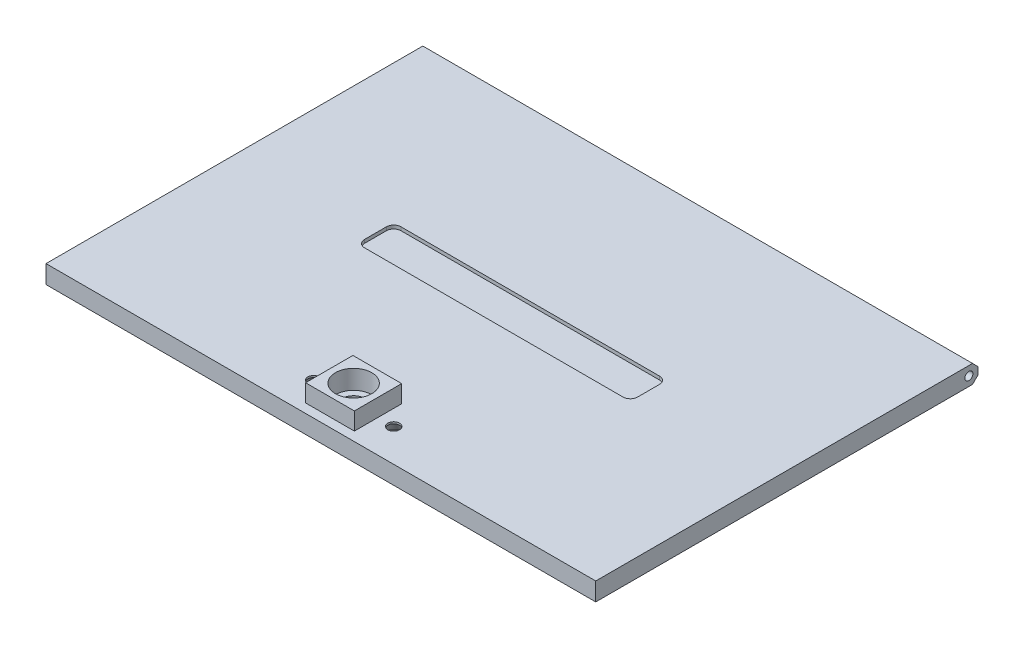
ISO-10303-21;
HEADER;
FILE_DESCRIPTION(('STEP AP214'),'2;1');
FILE_NAME('part.step','',(''),(''),'','','');
FILE_SCHEMA(('AUTOMOTIVE_DESIGN { 1 0 10303 214 1 1 1 1 }'));
ENDSEC;
DATA;
#1=APPLICATION_CONTEXT('core data for automotive mechanical design processes');
#2=APPLICATION_PROTOCOL_DEFINITION('international standard','automotive_design',2000,#1);
#3=PRODUCT_CONTEXT('',#1,'mechanical');
#4=PRODUCT('Part','Part','',(#3));
#5=PRODUCT_RELATED_PRODUCT_CATEGORY('part','',(#4));
#6=PRODUCT_DEFINITION_FORMATION('','',#4);
#7=PRODUCT_DEFINITION_CONTEXT('part definition',#1,'design');
#8=PRODUCT_DEFINITION('design','',#6,#7);
#9=PRODUCT_DEFINITION_SHAPE('','',#8);
#10=(LENGTH_UNIT() NAMED_UNIT(*) SI_UNIT(.MILLI.,.METRE.));
#11=(NAMED_UNIT(*) PLANE_ANGLE_UNIT() SI_UNIT($,.RADIAN.));
#12=(NAMED_UNIT(*) SI_UNIT($,.STERADIAN.) SOLID_ANGLE_UNIT());
#13=UNCERTAINTY_MEASURE_WITH_UNIT(LENGTH_MEASURE(1.E-05),#10,'distance_accuracy_value','');
#14=(GEOMETRIC_REPRESENTATION_CONTEXT(3) GLOBAL_UNCERTAINTY_ASSIGNED_CONTEXT((#13)) GLOBAL_UNIT_ASSIGNED_CONTEXT((#10,
#11,#12)) REPRESENTATION_CONTEXT('',''));
#15=CARTESIAN_POINT('',(0.,0.,0.));
#16=DIRECTION('',(0.,0.,1.));
#17=DIRECTION('',(1.,0.,0.));
#18=AXIS2_PLACEMENT_3D('',#15,#16,#17);
#19=CARTESIAN_POINT('',(12208.130226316,-6272.64336838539,-2094.91182438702));
#20=DIRECTION('',(0.,1.,0.));
#21=DIRECTION('',(-1.,0.,0.));
#22=AXIS2_PLACEMENT_3D('',#19,#20,#21);
#23=CYLINDRICAL_SURFACE('',#22,3.19999999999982);
#24=CARTESIAN_POINT('',(12208.130226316,-6272.64336838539,-2094.91182438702));
#25=DIRECTION('',(0.,1.,0.));
#26=DIRECTION('',(-1.,0.,0.));
#27=AXIS2_PLACEMENT_3D('',#24,#25,#26);
#28=CIRCLE('',#27,3.19999999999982);
#29=CARTESIAN_POINT('',(12204.930226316,-6272.64336838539,-2094.91182438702));
#30=VERTEX_POINT('',#29);
#31=EDGE_CURVE('E18',#30,#30,#28,.T.);
#32=ORIENTED_EDGE('',*,*,#31,.F.);
#33=EDGE_LOOP('',(#32));
#34=FACE_BOUND('',#33,.T.);
#35=CARTESIAN_POINT('',(12208.130226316,-6271.08610733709,-2094.91182438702));
#36=DIRECTION('',(0.,1.,0.));
#37=DIRECTION('',(-1.,0.,0.));
#38=AXIS2_PLACEMENT_3D('',#35,#36,#37);
#39=CIRCLE('',#38,3.19999999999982);
#40=CARTESIAN_POINT('',(12204.930226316,-6271.08610733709,-2094.91182438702));
#41=VERTEX_POINT('',#40);
#42=EDGE_CURVE('E442',#41,#41,#39,.F.);
#43=ORIENTED_EDGE('',*,*,#42,.F.);
#44=EDGE_LOOP('',(#43));
#45=FACE_BOUND('',#44,.T.);
#46=ADVANCED_FACE('F15',(#34,#45),#23,.F.);
#47=CARTESIAN_POINT('',(12208.130055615,-6272.64336838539,-2094.91182438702));
#48=DIRECTION('',(0.,-1.,0.));
#49=DIRECTION('',(1.,0.,0.));
#50=AXIS2_PLACEMENT_3D('',#47,#48,#49);
#51=PLANE('',#50);
#52=CARTESIAN_POINT('',(12208.130226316,-6272.64336838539,-2094.91182438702));
#53=DIRECTION('',(0.,1.,0.));
#54=DIRECTION('',(-1.,0.,0.));
#55=AXIS2_PLACEMENT_3D('',#52,#53,#54);
#56=CIRCLE('',#55,4.00000000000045);
#57=CARTESIAN_POINT('',(12204.130226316,-6272.64336838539,-2094.91182438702));
#58=VERTEX_POINT('',#57);
#59=EDGE_CURVE('E440',#58,#58,#56,.F.);
#60=ORIENTED_EDGE('',*,*,#59,.T.);
#61=EDGE_LOOP('',(#60));
#62=FACE_BOUND('',#61,.T.);
#63=ORIENTED_EDGE('',*,*,#31,.T.);
#64=EDGE_LOOP('',(#63));
#65=FACE_BOUND('',#64,.T.);
#66=ADVANCED_FACE('F449',(#62,#65),#51,.T.);
#67=CARTESIAN_POINT('',(12208.130226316,-6271.08610733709,-2094.91182438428));
#68=DIRECTION('',(0.,1.,0.));
#69=DIRECTION('',(0.,0.,1.));
#70=AXIS2_PLACEMENT_3D('',#67,#68,#69);
#71=PLANE('',#70);
#72=CARTESIAN_POINT('',(12208.130226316,-6271.08610733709,-2094.91182438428));
#73=DIRECTION('',(0.,-1.,0.));
#74=DIRECTION('',(1.,0.,0.));
#75=AXIS2_PLACEMENT_3D('',#72,#73,#74);
#76=CIRCLE('',#75,5.);
#77=CARTESIAN_POINT('',(12213.130226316,-6271.08610733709,-2094.91182438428));
#78=VERTEX_POINT('',#77);
#79=EDGE_CURVE('E437',#78,#78,#76,.F.);
#80=ORIENTED_EDGE('',*,*,#79,.T.);
#81=EDGE_LOOP('',(#80));
#82=FACE_BOUND('',#81,.T.);
#83=ORIENTED_EDGE('',*,*,#42,.T.);
#84=EDGE_LOOP('',(#83));
#85=FACE_BOUND('',#84,.T.);
#86=ADVANCED_FACE('F457',(#82,#85),#71,.T.);
#87=CARTESIAN_POINT('',(12208.130226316,-6273.64336838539,-2094.91182438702));
#88=DIRECTION('',(0.,1.,0.));
#89=DIRECTION('',(-1.,0.,0.));
#90=AXIS2_PLACEMENT_3D('',#87,#88,#89);
#91=CYLINDRICAL_SURFACE('',#90,4.00000000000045);
#92=ORIENTED_EDGE('',*,*,#59,.F.);
#93=EDGE_LOOP('',(#92));
#94=FACE_BOUND('',#93,.T.);
#95=CARTESIAN_POINT('',(12208.130226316,-6273.64336838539,-2094.91182438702));
#96=DIRECTION('',(0.,1.,0.));
#97=DIRECTION('',(-1.,0.,0.));
#98=AXIS2_PLACEMENT_3D('',#95,#96,#97);
#99=CIRCLE('',#98,4.00000000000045);
#100=CARTESIAN_POINT('',(12204.130226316,-6273.64336838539,-2094.91182438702));
#101=VERTEX_POINT('',#100);
#102=EDGE_CURVE('E383',#101,#101,#99,.T.);
#103=ORIENTED_EDGE('',*,*,#102,.F.);
#104=EDGE_LOOP('',(#103));
#105=FACE_BOUND('',#104,.T.);
#106=ADVANCED_FACE('F636',(#94,#105),#91,.F.);
#107=CARTESIAN_POINT('',(12207.9302263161,-6273.14336838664,-2147.91182439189));
#108=DIRECTION('',(0.,-1.,0.));
#109=DIRECTION('',(1.,0.,0.));
#110=AXIS2_PLACEMENT_3D('',#107,#108,#109);
#111=PLANE('',#110);
#112=DIRECTION('',(0.,0.,1.));
#113=VECTOR('',#112,1.);
#114=CARTESIAN_POINT('',(12269.4302263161,-6273.14336838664,-2147.91182439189));
#115=LINE('',#114,#113);
#116=CARTESIAN_POINT('',(12269.4302263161,-6273.14336838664,-2110.4118243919));
#117=VERTEX_POINT('',#116);
#118=CARTESIAN_POINT('',(12269.4302263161,-6273.14336838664,-2182.91182439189));
#119=VERTEX_POINT('',#118);
#120=EDGE_CURVE('E380',#117,#119,#115,.F.);
#121=ORIENTED_EDGE('',*,*,#120,.F.);
#122=DIRECTION('',(1.,0.,0.));
#123=VECTOR('',#122,1.);
#124=CARTESIAN_POINT('',(12207.9302263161,-6273.14336838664,-2110.4118243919));
#125=LINE('',#124,#123);
#126=CARTESIAN_POINT('',(12146.4302263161,-6273.14336838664,-2110.4118243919));
#127=VERTEX_POINT('',#126);
#128=EDGE_CURVE('E365',#127,#117,#125,.T.);
#129=ORIENTED_EDGE('',*,*,#128,.F.);
#130=DIRECTION('',(0.,0.,1.));
#131=VECTOR('',#130,1.);
#132=CARTESIAN_POINT('',(12146.4302263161,-6273.14336838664,-2147.91182439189));
#133=LINE('',#132,#131);
#134=CARTESIAN_POINT('',(12146.4302263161,-6273.14336838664,-2182.91182439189));
#135=VERTEX_POINT('',#134);
#136=EDGE_CURVE('E371',#135,#127,#133,.T.);
#137=ORIENTED_EDGE('',*,*,#136,.F.);
#138=DIRECTION('',(-1.,0.,0.));
#139=VECTOR('',#138,1.);
#140=CARTESIAN_POINT('',(12146.4302263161,-6273.14336838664,-2182.91182439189));
#141=LINE('',#140,#139);
#142=EDGE_CURVE('E378',#135,#119,#141,.F.);
#143=ORIENTED_EDGE('',*,*,#142,.T.);
#144=EDGE_LOOP('',(#121,#129,#137,#143));
#145=FACE_BOUND('',#144,.T.);
#146=ADVANCED_FACE('F632',(#145),#111,.T.);
#147=CARTESIAN_POINT('',(12208.130226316,-6266.28610733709,-2094.91182438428));
#148=DIRECTION('',(0.,-1.,0.));
#149=DIRECTION('',(1.,0.,0.));
#150=AXIS2_PLACEMENT_3D('',#147,#148,#149);
#151=CYLINDRICAL_SURFACE('',#150,5.);
#152=CARTESIAN_POINT('',(12208.130226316,-6265.84610733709,-2094.91182438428));
#153=DIRECTION('',(0.,-1.,0.));
#154=DIRECTION('',(1.,0.,0.));
#155=AXIS2_PLACEMENT_3D('',#152,#153,#154);
#156=CIRCLE('',#155,5.);
#157=CARTESIAN_POINT('',(12213.130226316,-6265.84610733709,-2094.91182438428));
#158=VERTEX_POINT('',#157);
#159=EDGE_CURVE('E430',#158,#158,#156,.T.);
#160=ORIENTED_EDGE('',*,*,#159,.F.);
#161=EDGE_LOOP('',(#160));
#162=FACE_BOUND('',#161,.T.);
#163=ORIENTED_EDGE('',*,*,#79,.F.);
#164=EDGE_LOOP('',(#163));
#165=FACE_BOUND('',#164,.T.);
#166=ADVANCED_FACE('F628',(#162,#165),#151,.F.);
#167=CARTESIAN_POINT('',(12208.1302263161,-6273.64336838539,-2099.63793904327));
#168=DIRECTION('',(0.,-1.,0.));
#169=DIRECTION('',(1.,0.,0.));
#170=AXIS2_PLACEMENT_3D('',#167,#168,#169);
#171=PLANE('',#170);
#172=CARTESIAN_POINT('',(12219.130226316,-6273.64336838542,-2094.91182438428));
#173=DIRECTION('',(0.,-1.,0.));
#174=DIRECTION('',(0.,0.,-1.));
#175=AXIS2_PLACEMENT_3D('',#172,#173,#174);
#176=CIRCLE('',#175,3.09999999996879);
#177=CARTESIAN_POINT('',(12219.130226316,-6273.64336838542,-2098.01182438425));
#178=VERTEX_POINT('',#177);
#179=EDGE_CURVE('E323',#178,#178,#176,.T.);
#180=ORIENTED_EDGE('',*,*,#179,.F.);
#181=EDGE_LOOP('',(#180));
#182=FACE_BOUND('',#181,.T.);
#183=DIRECTION('',(1.,0.,0.));
#184=VECTOR('',#183,1.);
#185=CARTESIAN_POINT('',(12163.3802263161,-6273.64336838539,-2092.41182439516));
#186=LINE('',#185,#184);
#187=CARTESIAN_POINT('',(12139.1302263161,-6273.64336838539,-2092.41182439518));
#188=VERTEX_POINT('',#187);
#189=CARTESIAN_POINT('',(12194.1302263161,-6273.64336838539,-2092.41182439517));
#190=VERTEX_POINT('',#189);
#191=EDGE_CURVE('E350',#188,#190,#186,.T.);
#192=ORIENTED_EDGE('',*,*,#191,.F.);
#193=DIRECTION('',(0.,0.,-1.));
#194=VECTOR('',#193,1.);
#195=CARTESIAN_POINT('',(12139.1302263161,-6273.64336838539,-2092.41182439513));
#196=LINE('',#195,#194);
#197=CARTESIAN_POINT('',(12139.1302263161,-6273.64336838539,-2107.9118243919));
#198=VERTEX_POINT('',#197);
#199=EDGE_CURVE('E355',#198,#188,#196,.F.);
#200=ORIENTED_EDGE('',*,*,#199,.F.);
#201=DIRECTION('',(1.,0.,0.));
#202=VECTOR('',#201,1.);
#203=CARTESIAN_POINT('',(12208.1302263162,-6273.64336838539,-2107.91182439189));
#204=LINE('',#203,#202);
#205=CARTESIAN_POINT('',(12277.1302263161,-6273.64336838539,-2107.91182439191));
#206=VERTEX_POINT('',#205);
#207=EDGE_CURVE('E360',#206,#198,#204,.F.);
#208=ORIENTED_EDGE('',*,*,#207,.F.);
#209=DIRECTION('',(0.,0.,1.));
#210=VECTOR('',#209,1.);
#211=CARTESIAN_POINT('',(12277.1302263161,-6273.64336838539,-2182.91182439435));
#212=LINE('',#211,#210);
#213=CARTESIAN_POINT('',(12277.1302263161,-6273.64336838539,-2092.41182439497));
#214=VERTEX_POINT('',#213);
#215=EDGE_CURVE('E320',#214,#206,#212,.F.);
#216=ORIENTED_EDGE('',*,*,#215,.F.);
#217=DIRECTION('',(1.,0.,0.));
#218=VECTOR('',#217,1.);
#219=CARTESIAN_POINT('',(12252.8802263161,-6273.64336838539,-2092.41182439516));
#220=LINE('',#219,#218);
#221=CARTESIAN_POINT('',(12222.1302263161,-6273.64336838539,-2092.41182439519));
#222=VERTEX_POINT('',#221);
#223=EDGE_CURVE('E330',#222,#214,#220,.T.);
#224=ORIENTED_EDGE('',*,*,#223,.F.);
#225=DIRECTION('',(0.,0.,1.));
#226=VECTOR('',#225,1.);
#227=CARTESIAN_POINT('',(12222.1302263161,-6273.64336838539,-2088.91182439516));
#228=LINE('',#227,#226);
#229=CARTESIAN_POINT('',(12222.1302263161,-6273.64336838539,-2088.91182439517));
#230=VERTEX_POINT('',#229);
#231=EDGE_CURVE('E335',#230,#222,#228,.F.);
#232=ORIENTED_EDGE('',*,*,#231,.F.);
#233=DIRECTION('',(1.,0.,0.));
#234=VECTOR('',#233,1.);
#235=CARTESIAN_POINT('',(12208.1302263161,-6273.64336838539,-2088.91182439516));
#236=LINE('',#235,#234);
#237=CARTESIAN_POINT('',(12194.1302263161,-6273.64336838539,-2088.91182439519));
#238=VERTEX_POINT('',#237);
#239=EDGE_CURVE('E340',#238,#230,#236,.T.);
#240=ORIENTED_EDGE('',*,*,#239,.F.);
#241=DIRECTION('',(0.,0.,-1.));
#242=VECTOR('',#241,1.);
#243=CARTESIAN_POINT('',(12194.1302263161,-6273.64336838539,-2088.91182439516));
#244=LINE('',#243,#242);
#245=EDGE_CURVE('E345',#190,#238,#244,.F.);
#246=ORIENTED_EDGE('',*,*,#245,.F.);
#247=EDGE_LOOP('',(#192,#200,#208,#216,#224,#232,#240,#246));
#248=FACE_BOUND('',#247,.T.);
#249=ORIENTED_EDGE('',*,*,#102,.T.);
#250=EDGE_LOOP('',(#249));
#251=FACE_BOUND('',#250,.T.);
#252=CARTESIAN_POINT('',(12197.130226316,-6273.64336838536,-2094.91182438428));
#253=DIRECTION('',(0.,-1.,0.));
#254=DIRECTION('',(0.,0.,-1.));
#255=AXIS2_PLACEMENT_3D('',#252,#253,#254);
#256=CIRCLE('',#255,3.10000000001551);
#257=CARTESIAN_POINT('',(12197.130226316,-6273.64336838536,-2098.01182438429));
#258=VERTEX_POINT('',#257);
#259=EDGE_CURVE('E427',#258,#258,#256,.T.);
#260=ORIENTED_EDGE('',*,*,#259,.F.);
#261=EDGE_LOOP('',(#260));
#262=FACE_BOUND('',#261,.T.);
#263=ADVANCED_FACE('F624',(#182,#248,#251,#262),#171,.T.);
#264=CARTESIAN_POINT('',(12278.1302263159,-6273.14473786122,-2188.41182439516));
#265=DIRECTION('',(1.,0.,0.));
#266=DIRECTION('',(0.,1.,0.));
#267=AXIS2_PLACEMENT_3D('',#264,#265,#266);
#268=PLANE('',#267);
#269=CARTESIAN_POINT('',(12278.1302263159,-6273.14473786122,-2188.41182439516));
#270=DIRECTION('',(-1.,0.,0.));
#271=DIRECTION('',(0.,-1.,0.));
#272=AXIS2_PLACEMENT_3D('',#269,#270,#271);
#273=CIRCLE('',#272,1.09999999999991);
#274=CARTESIAN_POINT('',(12278.1302263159,-6274.24473786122,-2188.41182439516));
#275=VERTEX_POINT('',#274);
#276=EDGE_CURVE('E424',#275,#275,#273,.F.);
#277=ORIENTED_EDGE('',*,*,#276,.T.);
#278=EDGE_LOOP('',(#277));
#279=FACE_BOUND('',#278,.T.);
#280=ADVANCED_FACE('F620',(#279),#268,.T.);
#281=CARTESIAN_POINT('',(12137.6302263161,-6273.14336838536,-2188.41319387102));
#282=DIRECTION('',(1.,0.,0.));
#283=DIRECTION('',(0.,1.,0.));
#284=AXIS2_PLACEMENT_3D('',#281,#282,#283);
#285=PLANE('',#284);
#286=CARTESIAN_POINT('',(12137.6302263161,-6273.14336838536,-2188.41319387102));
#287=DIRECTION('',(1.,0.,0.));
#288=DIRECTION('',(0.,1.,0.));
#289=AXIS2_PLACEMENT_3D('',#286,#287,#288);
#290=CIRCLE('',#289,1.09999999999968);
#291=CARTESIAN_POINT('',(12137.6302263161,-6272.04336838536,-2188.41319387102));
#292=VERTEX_POINT('',#291);
#293=EDGE_CURVE('E301',#292,#292,#290,.F.);
#294=ORIENTED_EDGE('',*,*,#293,.T.);
#295=EDGE_LOOP('',(#294));
#296=FACE_BOUND('',#295,.T.);
#297=ADVANCED_FACE('F616',(#296),#285,.F.);
#298=CARTESIAN_POINT('',(12269.4302263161,-6274.39336838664,-2147.91182439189));
#299=DIRECTION('',(-1.,0.,0.));
#300=DIRECTION('',(0.,-1.,0.));
#301=AXIS2_PLACEMENT_3D('',#298,#299,#300);
#302=PLANE('',#301);
#303=DIRECTION('',(0.,1.,0.));
#304=VECTOR('',#303,1.);
#305=CARTESIAN_POINT('',(12269.4302263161,-6274.39336838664,-2110.4118243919));
#306=LINE('',#305,#304);
#307=CARTESIAN_POINT('',(12269.4302263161,-6275.64336838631,-2110.4118243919));
#308=VERTEX_POINT('',#307);
#309=EDGE_CURVE('E362',#117,#308,#306,.F.);
#310=ORIENTED_EDGE('',*,*,#309,.F.);
#311=ORIENTED_EDGE('',*,*,#120,.T.);
#312=DIRECTION('',(0.,1.,0.));
#313=VECTOR('',#312,1.);
#314=CARTESIAN_POINT('',(12269.4302263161,-6275.64336838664,-2182.91182439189));
#315=LINE('',#314,#313);
#316=CARTESIAN_POINT('',(12269.4302263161,-6275.64336838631,-2182.91182439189));
#317=VERTEX_POINT('',#316);
#318=EDGE_CURVE('E376',#119,#317,#315,.F.);
#319=ORIENTED_EDGE('',*,*,#318,.T.);
#320=DIRECTION('',(0.,0.,1.));
#321=VECTOR('',#320,1.);
#322=CARTESIAN_POINT('',(12269.4302263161,-6275.64336838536,-2190.91182439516));
#323=LINE('',#322,#321);
#324=EDGE_CURVE('E296',#308,#317,#323,.F.);
#325=ORIENTED_EDGE('',*,*,#324,.F.);
#326=EDGE_LOOP('',(#310,#311,#319,#325));
#327=FACE_BOUND('',#326,.T.);
#328=ADVANCED_FACE('F612',(#327),#302,.T.);
#329=CARTESIAN_POINT('',(12146.4302263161,-6275.64336838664,-2182.91182439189));
#330=DIRECTION('',(0.,0.,-1.));
#331=DIRECTION('',(-1.,0.,0.));
#332=AXIS2_PLACEMENT_3D('',#329,#330,#331);
#333=PLANE('',#332);
#334=DIRECTION('',(1.,0.,0.));
#335=VECTOR('',#334,1.);
#336=CARTESIAN_POINT('',(12139.4502263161,-6275.64336838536,-2182.91182439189));
#337=LINE('',#336,#335);
#338=CARTESIAN_POINT('',(12146.4302263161,-6275.64336838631,-2182.91182439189));
#339=VERTEX_POINT('',#338);
#340=EDGE_CURVE('E293',#317,#339,#337,.F.);
#341=ORIENTED_EDGE('',*,*,#340,.F.);
#342=ORIENTED_EDGE('',*,*,#318,.F.);
#343=ORIENTED_EDGE('',*,*,#142,.F.);
#344=DIRECTION('',(0.,1.,0.));
#345=VECTOR('',#344,1.);
#346=CARTESIAN_POINT('',(12146.4302263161,-6274.39336838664,-2182.91182439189));
#347=LINE('',#346,#345);
#348=EDGE_CURVE('E373',#339,#135,#347,.T.);
#349=ORIENTED_EDGE('',*,*,#348,.F.);
#350=EDGE_LOOP('',(#341,#342,#343,#349));
#351=FACE_BOUND('',#350,.T.);
#352=ADVANCED_FACE('F608',(#351),#333,.F.);
#353=CARTESIAN_POINT('',(12146.4302263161,-6274.39336838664,-2147.91182439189));
#354=DIRECTION('',(1.,0.,0.));
#355=DIRECTION('',(0.,1.,0.));
#356=AXIS2_PLACEMENT_3D('',#353,#354,#355);
#357=PLANE('',#356);
#358=ORIENTED_EDGE('',*,*,#136,.T.);
#359=DIRECTION('',(0.,1.,0.));
#360=VECTOR('',#359,1.);
#361=CARTESIAN_POINT('',(12146.4302263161,-6274.39336838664,-2110.4118243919));
#362=LINE('',#361,#360);
#363=CARTESIAN_POINT('',(12146.4302263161,-6275.64336838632,-2110.4118243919));
#364=VERTEX_POINT('',#363);
#365=EDGE_CURVE('E368',#364,#127,#362,.T.);
#366=ORIENTED_EDGE('',*,*,#365,.F.);
#367=DIRECTION('',(0.,0.,1.));
#368=VECTOR('',#367,1.);
#369=CARTESIAN_POINT('',(12146.4302263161,-6275.64336838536,-2190.91182439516));
#370=LINE('',#369,#368);
#371=EDGE_CURVE('E290',#339,#364,#370,.T.);
#372=ORIENTED_EDGE('',*,*,#371,.F.);
#373=ORIENTED_EDGE('',*,*,#348,.T.);
#374=EDGE_LOOP('',(#358,#366,#372,#373));
#375=FACE_BOUND('',#374,.T.);
#376=ADVANCED_FACE('F604',(#375),#357,.T.);
#377=CARTESIAN_POINT('',(12207.9302263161,-6274.39336838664,-2110.4118243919));
#378=DIRECTION('',(0.,0.,-1.));
#379=DIRECTION('',(0.,1.,0.));
#380=AXIS2_PLACEMENT_3D('',#377,#378,#379);
#381=PLANE('',#380);
#382=ORIENTED_EDGE('',*,*,#309,.T.);
#383=DIRECTION('',(1.,0.,0.));
#384=VECTOR('',#383,1.);
#385=CARTESIAN_POINT('',(12139.4502263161,-6275.64336838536,-2110.4118243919));
#386=LINE('',#385,#384);
#387=EDGE_CURVE('E287',#364,#308,#386,.T.);
#388=ORIENTED_EDGE('',*,*,#387,.F.);
#389=ORIENTED_EDGE('',*,*,#365,.T.);
#390=ORIENTED_EDGE('',*,*,#128,.T.);
#391=EDGE_LOOP('',(#382,#388,#389,#390));
#392=FACE_BOUND('',#391,.T.);
#393=ADVANCED_FACE('F600',(#392),#381,.T.);
#394=CARTESIAN_POINT('',(12208.1302263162,-6274.39336838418,-2107.91182439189));
#395=DIRECTION('',(0.,0.,1.));
#396=DIRECTION('',(0.,-1.,0.));
#397=AXIS2_PLACEMENT_3D('',#394,#395,#396);
#398=PLANE('',#397);
#399=DIRECTION('',(0.,1.,0.));
#400=VECTOR('',#399,1.);
#401=CARTESIAN_POINT('',(12277.1302263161,-6273.14336837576,-2107.91182439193));
#402=LINE('',#401,#400);
#403=CARTESIAN_POINT('',(12277.1302263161,-6275.64336838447,-2107.9118243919));
#404=VERTEX_POINT('',#403);
#405=EDGE_CURVE('E327',#206,#404,#402,.F.);
#406=ORIENTED_EDGE('',*,*,#405,.F.);
#407=ORIENTED_EDGE('',*,*,#207,.T.);
#408=DIRECTION('',(0.,1.,0.));
#409=VECTOR('',#408,1.);
#410=CARTESIAN_POINT('',(12139.1302263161,-6273.14336838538,-2107.91182439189));
#411=LINE('',#410,#409);
#412=CARTESIAN_POINT('',(12139.1302263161,-6275.64336838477,-2107.91182439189));
#413=VERTEX_POINT('',#412);
#414=EDGE_CURVE('E357',#413,#198,#411,.T.);
#415=ORIENTED_EDGE('',*,*,#414,.F.);
#416=DIRECTION('',(1.,0.,0.));
#417=VECTOR('',#416,1.);
#418=CARTESIAN_POINT('',(12139.4502263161,-6275.64336838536,-2107.91182439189));
#419=LINE('',#418,#417);
#420=EDGE_CURVE('E282',#404,#413,#419,.F.);
#421=ORIENTED_EDGE('',*,*,#420,.F.);
#422=EDGE_LOOP('',(#406,#407,#415,#421));
#423=FACE_BOUND('',#422,.T.);
#424=ADVANCED_FACE('F596',(#423),#398,.T.);
#425=CARTESIAN_POINT('',(12139.1302263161,-6273.14336838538,-2092.41182439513));
#426=DIRECTION('',(1.,0.,0.));
#427=DIRECTION('',(0.,0.,-1.));
#428=AXIS2_PLACEMENT_3D('',#425,#426,#427);
#429=PLANE('',#428);
#430=ORIENTED_EDGE('',*,*,#414,.T.);
#431=ORIENTED_EDGE('',*,*,#199,.T.);
#432=DIRECTION('',(0.,1.,-6.60077062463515E-13));
#433=VECTOR('',#432,1.);
#434=CARTESIAN_POINT('',(12139.1302263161,-6274.39336838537,-2092.41182439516));
#435=LINE('',#434,#433);
#436=CARTESIAN_POINT('',(12139.1302263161,-6275.64336838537,-2092.41182439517));
#437=VERTEX_POINT('',#436);
#438=EDGE_CURVE('E352',#437,#188,#435,.T.);
#439=ORIENTED_EDGE('',*,*,#438,.F.);
#440=DIRECTION('',(0.,0.,1.));
#441=VECTOR('',#440,1.);
#442=CARTESIAN_POINT('',(12139.1302263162,-6275.64336838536,-2190.91182439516));
#443=LINE('',#442,#441);
#444=EDGE_CURVE('E279',#413,#437,#443,.T.);
#445=ORIENTED_EDGE('',*,*,#444,.F.);
#446=EDGE_LOOP('',(#430,#431,#439,#445));
#447=FACE_BOUND('',#446,.T.);
#448=ADVANCED_FACE('F592',(#447),#429,.T.);
#449=CARTESIAN_POINT('',(12163.3802263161,-6274.39336838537,-2092.41182439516));
#450=DIRECTION('',(0.,-6.60077062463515E-13,-1.));
#451=DIRECTION('',(0.,1.,-6.60077062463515E-13));
#452=AXIS2_PLACEMENT_3D('',#449,#450,#451);
#453=PLANE('',#452);
#454=ORIENTED_EDGE('',*,*,#438,.T.);
#455=ORIENTED_EDGE('',*,*,#191,.T.);
#456=DIRECTION('',(0.,1.,0.));
#457=VECTOR('',#456,1.);
#458=CARTESIAN_POINT('',(12194.1302263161,-6275.64336838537,-2092.41182439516));
#459=LINE('',#458,#457);
#460=CARTESIAN_POINT('',(12194.1302263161,-6275.64336838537,-2092.41182439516));
#461=VERTEX_POINT('',#460);
#462=EDGE_CURVE('E347',#461,#190,#459,.T.);
#463=ORIENTED_EDGE('',*,*,#462,.F.);
#464=DIRECTION('',(1.,0.,0.));
#465=VECTOR('',#464,1.);
#466=CARTESIAN_POINT('',(12139.4502263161,-6275.64336838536,-2092.41182439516));
#467=LINE('',#466,#465);
#468=EDGE_CURVE('E276',#437,#461,#467,.T.);
#469=ORIENTED_EDGE('',*,*,#468,.F.);
#470=EDGE_LOOP('',(#454,#455,#463,#469));
#471=FACE_BOUND('',#470,.T.);
#472=ADVANCED_FACE('F588',(#471),#453,.T.);
#473=CARTESIAN_POINT('',(12194.1302263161,-6275.64336838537,-2088.91182439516));
#474=DIRECTION('',(1.,0.,0.));
#475=DIRECTION('',(0.,0.,-1.));
#476=AXIS2_PLACEMENT_3D('',#473,#474,#475);
#477=PLANE('',#476);
#478=ORIENTED_EDGE('',*,*,#462,.T.);
#479=ORIENTED_EDGE('',*,*,#245,.T.);
#480=DIRECTION('',(0.,1.,-8.44690912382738E-13));
#481=VECTOR('',#480,1.);
#482=CARTESIAN_POINT('',(12194.1302263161,-6274.39336838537,-2088.91182439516));
#483=LINE('',#482,#481);
#484=CARTESIAN_POINT('',(12194.1302263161,-6275.64336838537,-2088.91182439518));
#485=VERTEX_POINT('',#484);
#486=EDGE_CURVE('E342',#485,#238,#483,.T.);
#487=ORIENTED_EDGE('',*,*,#486,.F.);
#488=DIRECTION('',(0.,0.,1.));
#489=VECTOR('',#488,1.);
#490=CARTESIAN_POINT('',(12194.1302263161,-6275.64336838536,-2190.91182439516));
#491=LINE('',#490,#489);
#492=EDGE_CURVE('E273',#461,#485,#491,.T.);
#493=ORIENTED_EDGE('',*,*,#492,.F.);
#494=EDGE_LOOP('',(#478,#479,#487,#493));
#495=FACE_BOUND('',#494,.T.);
#496=ADVANCED_FACE('F584',(#495),#477,.T.);
#497=CARTESIAN_POINT('',(12208.1302263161,-6274.39336838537,-2088.91182439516));
#498=DIRECTION('',(0.,-8.44690912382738E-13,-1.));
#499=DIRECTION('',(0.,1.,-8.44690912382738E-13));
#500=AXIS2_PLACEMENT_3D('',#497,#498,#499);
#501=PLANE('',#500);
#502=ORIENTED_EDGE('',*,*,#486,.T.);
#503=ORIENTED_EDGE('',*,*,#239,.T.);
#504=DIRECTION('',(0.,1.,0.));
#505=VECTOR('',#504,1.);
#506=CARTESIAN_POINT('',(12222.1302263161,-6273.14336838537,-2088.91182439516));
#507=LINE('',#506,#505);
#508=CARTESIAN_POINT('',(12222.1302263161,-6275.64336838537,-2088.91182439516));
#509=VERTEX_POINT('',#508);
#510=EDGE_CURVE('E337',#509,#230,#507,.T.);
#511=ORIENTED_EDGE('',*,*,#510,.F.);
#512=DIRECTION('',(1.,0.,0.));
#513=VECTOR('',#512,1.);
#514=CARTESIAN_POINT('',(12139.4502263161,-6275.64336838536,-2088.91182439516));
#515=LINE('',#514,#513);
#516=EDGE_CURVE('E270',#485,#509,#515,.T.);
#517=ORIENTED_EDGE('',*,*,#516,.F.);
#518=EDGE_LOOP('',(#502,#503,#511,#517));
#519=FACE_BOUND('',#518,.T.);
#520=ADVANCED_FACE('F580',(#519),#501,.T.);
#521=CARTESIAN_POINT('',(12222.1302263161,-6273.14336838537,-2088.91182439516));
#522=DIRECTION('',(-1.,0.,0.));
#523=DIRECTION('',(0.,0.,1.));
#524=AXIS2_PLACEMENT_3D('',#521,#522,#523);
#525=PLANE('',#524);
#526=ORIENTED_EDGE('',*,*,#510,.T.);
#527=ORIENTED_EDGE('',*,*,#231,.T.);
#528=DIRECTION('',(0.,1.,-6.17456103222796E-13));
#529=VECTOR('',#528,1.);
#530=CARTESIAN_POINT('',(12222.1302263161,-6274.39336838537,-2092.41182439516));
#531=LINE('',#530,#529);
#532=CARTESIAN_POINT('',(12222.1302263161,-6275.64336838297,-2092.41182439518));
#533=VERTEX_POINT('',#532);
#534=EDGE_CURVE('E332',#533,#222,#531,.T.);
#535=ORIENTED_EDGE('',*,*,#534,.F.);
#536=DIRECTION('',(0.,0.,1.));
#537=VECTOR('',#536,1.);
#538=CARTESIAN_POINT('',(12222.1302263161,-6275.64336838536,-2190.91182439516));
#539=LINE('',#538,#537);
#540=EDGE_CURVE('E267',#509,#533,#539,.F.);
#541=ORIENTED_EDGE('',*,*,#540,.F.);
#542=EDGE_LOOP('',(#526,#527,#535,#541));
#543=FACE_BOUND('',#542,.T.);
#544=ADVANCED_FACE('F576',(#543),#525,.T.);
#545=CARTESIAN_POINT('',(12252.8802263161,-6274.39336838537,-2092.41182439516));
#546=DIRECTION('',(0.,-6.17456103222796E-13,-1.));
#547=DIRECTION('',(0.,1.,-6.17456103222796E-13));
#548=AXIS2_PLACEMENT_3D('',#545,#546,#547);
#549=PLANE('',#548);
#550=ORIENTED_EDGE('',*,*,#534,.T.);
#551=ORIENTED_EDGE('',*,*,#223,.T.);
#552=DIRECTION('',(0.,1.,0.));
#553=VECTOR('',#552,1.);
#554=CARTESIAN_POINT('',(12277.1302263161,-6273.14336837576,-2092.41182439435));
#555=LINE('',#554,#553);
#556=CARTESIAN_POINT('',(12277.1302263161,-6275.64336838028,-2092.41182439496));
#557=VERTEX_POINT('',#556);
#558=EDGE_CURVE('E324',#557,#214,#555,.T.);
#559=ORIENTED_EDGE('',*,*,#558,.F.);
#560=DIRECTION('',(1.,0.,0.));
#561=VECTOR('',#560,1.);
#562=CARTESIAN_POINT('',(12139.4502263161,-6275.64336838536,-2092.41182439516));
#563=LINE('',#562,#561);
#564=EDGE_CURVE('E264',#533,#557,#563,.T.);
#565=ORIENTED_EDGE('',*,*,#564,.F.);
#566=EDGE_LOOP('',(#550,#551,#559,#565));
#567=FACE_BOUND('',#566,.T.);
#568=ADVANCED_FACE('F572',(#567),#549,.T.);
#569=CARTESIAN_POINT('',(12277.1302263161,-6273.14336837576,-2182.91182439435));
#570=DIRECTION('',(-1.,0.,0.));
#571=DIRECTION('',(0.,0.,1.));
#572=AXIS2_PLACEMENT_3D('',#569,#570,#571);
#573=PLANE('',#572);
#574=ORIENTED_EDGE('',*,*,#558,.T.);
#575=ORIENTED_EDGE('',*,*,#215,.T.);
#576=ORIENTED_EDGE('',*,*,#405,.T.);
#577=DIRECTION('',(0.,0.,1.));
#578=VECTOR('',#577,1.);
#579=CARTESIAN_POINT('',(12277.1302263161,-6275.64336838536,-2190.91182439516));
#580=LINE('',#579,#578);
#581=EDGE_CURVE('E261',#557,#404,#580,.F.);
#582=ORIENTED_EDGE('',*,*,#581,.F.);
#583=EDGE_LOOP('',(#574,#575,#576,#582));
#584=FACE_BOUND('',#583,.T.);
#585=ADVANCED_FACE('F568',(#584),#573,.T.);
#586=CARTESIAN_POINT('',(12219.130226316,-6271.14336838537,-2094.91182438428));
#587=DIRECTION('',(0.,-1.,0.));
#588=DIRECTION('',(0.,0.,-1.));
#589=AXIS2_PLACEMENT_3D('',#586,#587,#588);
#590=CONICAL_SURFACE('',#589,1.59999999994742,0.540419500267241);
#591=CARTESIAN_POINT('',(12219.130226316,-6271.14336838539,-2094.91182438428));
#592=DIRECTION('',(0.,-1.,0.));
#593=DIRECTION('',(0.,0.,-1.));
#594=AXIS2_PLACEMENT_3D('',#591,#592,#593);
#595=CIRCLE('',#594,1.59999999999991);
#596=CARTESIAN_POINT('',(12219.130226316,-6271.14336838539,-2096.51182438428));
#597=VERTEX_POINT('',#596);
#598=EDGE_CURVE('E260',#597,#597,#595,.T.);
#599=ORIENTED_EDGE('',*,*,#598,.F.);
#600=EDGE_LOOP('',(#599));
#601=FACE_BOUND('',#600,.T.);
#602=ORIENTED_EDGE('',*,*,#179,.T.);
#603=EDGE_LOOP('',(#602));
#604=FACE_BOUND('',#603,.T.);
#605=ADVANCED_FACE('F564',(#601,#604),#590,.F.);
#606=CARTESIAN_POINT('',(12208.130226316,-6265.84610733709,-2094.91182438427));
#607=DIRECTION('',(0.,1.,1.4237803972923E-13));
#608=DIRECTION('',(0.,-1.4237803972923E-13,1.));
#609=AXIS2_PLACEMENT_3D('',#606,#607,#608);
#610=PLANE('',#609);
#611=DIRECTION('',(1.,0.,0.));
#612=VECTOR('',#611,1.);
#613=CARTESIAN_POINT('',(12201.430226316,-6265.84610733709,-2101.41182438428));
#614=LINE('',#613,#612);
#615=CARTESIAN_POINT('',(12201.430226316,-6265.84610733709,-2101.41182438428));
#616=VERTEX_POINT('',#615);
#617=CARTESIAN_POINT('',(12214.830226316,-6265.84610733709,-2101.41182438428));
#618=VERTEX_POINT('',#617);
#619=EDGE_CURVE('E258',#616,#618,#614,.T.);
#620=ORIENTED_EDGE('',*,*,#619,.F.);
#621=DIRECTION('',(0.,0.,1.));
#622=VECTOR('',#621,1.);
#623=CARTESIAN_POINT('',(12201.430226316,-6265.84610733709,-2088.41182438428));
#624=LINE('',#623,#622);
#625=CARTESIAN_POINT('',(12201.430226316,-6265.84610733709,-2088.41182438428));
#626=VERTEX_POINT('',#625);
#627=EDGE_CURVE('E242',#626,#616,#624,.F.);
#628=ORIENTED_EDGE('',*,*,#627,.F.);
#629=DIRECTION('',(1.,0.,0.));
#630=VECTOR('',#629,1.);
#631=CARTESIAN_POINT('',(12214.830226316,-6265.84610733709,-2088.41182438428));
#632=LINE('',#631,#630);
#633=CARTESIAN_POINT('',(12214.830226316,-6265.84610733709,-2088.41182438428));
#634=VERTEX_POINT('',#633);
#635=EDGE_CURVE('E248',#634,#626,#632,.F.);
#636=ORIENTED_EDGE('',*,*,#635,.F.);
#637=DIRECTION('',(0.,0.,-1.));
#638=VECTOR('',#637,1.);
#639=CARTESIAN_POINT('',(12214.830226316,-6265.84610733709,-2101.41182438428));
#640=LINE('',#639,#638);
#641=EDGE_CURVE('E253',#618,#634,#640,.F.);
#642=ORIENTED_EDGE('',*,*,#641,.F.);
#643=EDGE_LOOP('',(#620,#628,#636,#642));
#644=FACE_BOUND('',#643,.T.);
#645=ORIENTED_EDGE('',*,*,#159,.T.);
#646=EDGE_LOOP('',(#645));
#647=FACE_BOUND('',#646,.T.);
#648=ADVANCED_FACE('F561',(#644,#647),#610,.T.);
#649=CARTESIAN_POINT('',(12208.1302263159,-6271.58610733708,-2137.91182439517));
#650=DIRECTION('',(0.,1.,-6.43024739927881E-13));
#651=DIRECTION('',(0.,6.43024739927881E-13,1.));
#652=AXIS2_PLACEMENT_3D('',#649,#650,#651);
#653=PLANE('',#652);
#654=DIRECTION('',(0.,0.,1.));
#655=VECTOR('',#654,1.);
#656=CARTESIAN_POINT('',(12170.6302263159,-6271.58610733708,-2140.41182439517));
#657=LINE('',#656,#655);
#658=CARTESIAN_POINT('',(12170.6302263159,-6271.58610733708,-2141.41182439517));
#659=VERTEX_POINT('',#658);
#660=CARTESIAN_POINT('',(12170.6302263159,-6271.58610733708,-2135.41182439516));
#661=VERTEX_POINT('',#660);
#662=EDGE_CURVE('E307',#659,#661,#657,.T.);
#663=ORIENTED_EDGE('',*,*,#662,.T.);
#664=CARTESIAN_POINT('',(12172.6302263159,-6271.58610733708,-2135.41182439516));
#665=DIRECTION('',(0.,-1.,6.39243542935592E-13));
#666=DIRECTION('',(0.,-6.39243542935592E-13,-1.));
#667=AXIS2_PLACEMENT_3D('',#664,#665,#666);
#668=CIRCLE('',#667,2.00000000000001);
#669=CARTESIAN_POINT('',(12172.6302263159,-6271.58610733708,-2133.41182439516));
#670=VERTEX_POINT('',#669);
#671=EDGE_CURVE('E417',#661,#670,#668,.F.);
#672=ORIENTED_EDGE('',*,*,#671,.T.);
#673=DIRECTION('',(1.,0.,0.));
#674=VECTOR('',#673,1.);
#675=CARTESIAN_POINT('',(12173.1302263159,-6271.58610733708,-2133.41182439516));
#676=LINE('',#675,#674);
#677=CARTESIAN_POINT('',(12243.6302263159,-6271.58610733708,-2133.41182439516));
#678=VERTEX_POINT('',#677);
#679=EDGE_CURVE('E311',#670,#678,#676,.T.);
#680=ORIENTED_EDGE('',*,*,#679,.T.);
#681=CARTESIAN_POINT('',(12243.6302263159,-6271.58610733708,-2135.41182439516));
#682=DIRECTION('',(0.,-1.,6.39243542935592E-13));
#683=DIRECTION('',(0.,-6.39243542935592E-13,-1.));
#684=AXIS2_PLACEMENT_3D('',#681,#682,#683);
#685=CIRCLE('',#684,1.99999999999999);
#686=CARTESIAN_POINT('',(12245.6302263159,-6271.58610733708,-2135.41182439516));
#687=VERTEX_POINT('',#686);
#688=EDGE_CURVE('E420',#678,#687,#685,.F.);
#689=ORIENTED_EDGE('',*,*,#688,.T.);
#690=DIRECTION('',(0.,0.,1.));
#691=VECTOR('',#690,1.);
#692=CARTESIAN_POINT('',(12245.6302263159,-6271.58610733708,-2135.41182439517));
#693=LINE('',#692,#691);
#694=CARTESIAN_POINT('',(12245.6302263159,-6271.58610733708,-2141.41182439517));
#695=VERTEX_POINT('',#694);
#696=EDGE_CURVE('E228',#687,#695,#693,.F.);
#697=ORIENTED_EDGE('',*,*,#696,.T.);
#698=CARTESIAN_POINT('',(12243.6302263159,-6271.58610733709,-2141.41182439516));
#699=DIRECTION('',(0.,-1.,6.39243542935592E-13));
#700=DIRECTION('',(0.,-6.39243542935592E-13,-1.));
#701=AXIS2_PLACEMENT_3D('',#698,#699,#700);
#702=CIRCLE('',#701,2.00000000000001);
#703=CARTESIAN_POINT('',(12243.6302263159,-6271.58610733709,-2143.41182439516));
#704=VERTEX_POINT('',#703);
#705=EDGE_CURVE('E209',#695,#704,#702,.F.);
#706=ORIENTED_EDGE('',*,*,#705,.T.);
#707=DIRECTION('',(1.,0.,0.));
#708=VECTOR('',#707,1.);
#709=CARTESIAN_POINT('',(12243.1302263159,-6271.58610733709,-2143.41182439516));
#710=LINE('',#709,#708);
#711=CARTESIAN_POINT('',(12172.6302263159,-6271.58610733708,-2143.41182439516));
#712=VERTEX_POINT('',#711);
#713=EDGE_CURVE('E214',#704,#712,#710,.F.);
#714=ORIENTED_EDGE('',*,*,#713,.T.);
#715=CARTESIAN_POINT('',(12172.6302263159,-6271.58610733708,-2141.41182439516));
#716=DIRECTION('',(0.,-1.,6.39243542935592E-13));
#717=DIRECTION('',(0.,-6.39243542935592E-13,-1.));
#718=AXIS2_PLACEMENT_3D('',#715,#716,#717);
#719=CIRCLE('',#718,2.00000000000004);
#720=EDGE_CURVE('E305',#712,#659,#719,.F.);
#721=ORIENTED_EDGE('',*,*,#720,.T.);
#722=EDGE_LOOP('',(#663,#672,#680,#689,#697,#706,#714,#721));
#723=FACE_BOUND('',#722,.T.);
#724=ADVANCED_FACE('F226',(#723),#653,.T.);
#725=CARTESIAN_POINT('',(12197.130226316,-6271.1433683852,-2094.91182438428));
#726=DIRECTION('',(0.,-1.,0.));
#727=DIRECTION('',(0.,0.,-1.));
#728=AXIS2_PLACEMENT_3D('',#725,#726,#727);
#729=CONICAL_SURFACE('',#728,1.59999999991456,0.540419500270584);
#730=CARTESIAN_POINT('',(12197.130226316,-6271.1433683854,-2094.91182438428));
#731=DIRECTION('',(0.,-1.,-1.3484482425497E-13));
#732=DIRECTION('',(0.,1.3484482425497E-13,-1.));
#733=AXIS2_PLACEMENT_3D('',#730,#731,#732);
#734=CIRCLE('',#733,1.59999999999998);
#735=CARTESIAN_POINT('',(12197.130226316,-6271.1433683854,-2096.51182438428));
#736=VERTEX_POINT('',#735);
#737=EDGE_CURVE('E302',#736,#736,#734,.F.);
#738=ORIENTED_EDGE('',*,*,#737,.T.);
#739=EDGE_LOOP('',(#738));
#740=FACE_BOUND('',#739,.T.);
#741=ORIENTED_EDGE('',*,*,#259,.T.);
#742=EDGE_LOOP('',(#741));
#743=FACE_BOUND('',#742,.T.);
#744=ADVANCED_FACE('F554',(#740,#743),#729,.F.);
#745=CARTESIAN_POINT('',(12283.6302263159,-6273.14473786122,-2188.41182439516));
#746=DIRECTION('',(-1.,0.,0.));
#747=DIRECTION('',(0.,-1.,0.));
#748=AXIS2_PLACEMENT_3D('',#745,#746,#747);
#749=CYLINDRICAL_SURFACE('',#748,1.09999999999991);
#750=CARTESIAN_POINT('',(12283.6302263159,-6273.14473786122,-2188.41182439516));
#751=DIRECTION('',(-1.,0.,0.));
#752=DIRECTION('',(0.,-1.,0.));
#753=AXIS2_PLACEMENT_3D('',#750,#751,#752);
#754=CIRCLE('',#753,1.09999999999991);
#755=CARTESIAN_POINT('',(12283.6302263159,-6274.24473786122,-2188.41182439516));
#756=VERTEX_POINT('',#755);
#757=EDGE_CURVE('E412',#756,#756,#754,.T.);
#758=ORIENTED_EDGE('',*,*,#757,.F.);
#759=EDGE_LOOP('',(#758));
#760=FACE_BOUND('',#759,.T.);
#761=ORIENTED_EDGE('',*,*,#276,.F.);
#762=EDGE_LOOP('',(#761));
#763=FACE_BOUND('',#762,.T.);
#764=ADVANCED_FACE('F550',(#760,#763),#749,.F.);
#765=CARTESIAN_POINT('',(12132.6302263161,-6273.14336838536,-2188.41319387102));
#766=DIRECTION('',(1.,0.,0.));
#767=DIRECTION('',(0.,1.,0.));
#768=AXIS2_PLACEMENT_3D('',#765,#766,#767);
#769=CYLINDRICAL_SURFACE('',#768,1.09999999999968);
#770=CARTESIAN_POINT('',(12132.6302263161,-6273.14336838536,-2188.41319387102));
#771=DIRECTION('',(1.,0.,0.));
#772=DIRECTION('',(0.,1.,0.));
#773=AXIS2_PLACEMENT_3D('',#770,#771,#772);
#774=CIRCLE('',#773,1.09999999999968);
#775=CARTESIAN_POINT('',(12132.6302263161,-6272.04336838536,-2188.41319387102));
#776=VERTEX_POINT('',#775);
#777=EDGE_CURVE('E407',#776,#776,#774,.T.);
#778=ORIENTED_EDGE('',*,*,#777,.F.);
#779=EDGE_LOOP('',(#778));
#780=FACE_BOUND('',#779,.T.);
#781=ORIENTED_EDGE('',*,*,#293,.F.);
#782=EDGE_LOOP('',(#781));
#783=FACE_BOUND('',#782,.T.);
#784=ADVANCED_FACE('F546',(#780,#783),#769,.F.);
#785=CARTESIAN_POINT('',(12139.4502263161,-6270.64336838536,-2190.91182439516));
#786=DIRECTION('',(0.,0.,-1.));
#787=DIRECTION('',(0.,1.,0.));
#788=AXIS2_PLACEMENT_3D('',#785,#786,#787);
#789=PLANE('',#788);
#790=DIRECTION('',(1.,0.,0.));
#791=VECTOR('',#790,1.);
#792=CARTESIAN_POINT('',(12139.4502263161,-6274.14336838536,-2190.91182439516));
#793=LINE('',#792,#791);
#794=CARTESIAN_POINT('',(12132.6302263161,-6274.14336838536,-2190.91182439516));
#795=VERTEX_POINT('',#794);
#796=CARTESIAN_POINT('',(12283.6302263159,-6274.14336838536,-2190.91182439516));
#797=VERTEX_POINT('',#796);
#798=EDGE_CURVE('E299',#795,#797,#793,.T.);
#799=ORIENTED_EDGE('',*,*,#798,.F.);
#800=DIRECTION('',(0.,-1.,0.));
#801=VECTOR('',#800,1.);
#802=CARTESIAN_POINT('',(12132.6302263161,-6273.14473786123,-2190.91182439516));
#803=LINE('',#802,#801);
#804=CARTESIAN_POINT('',(12132.6302263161,-6272.14610733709,-2190.91182439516));
#805=VERTEX_POINT('',#804);
#806=EDGE_CURVE('E1121',#805,#795,#803,.T.);
#807=ORIENTED_EDGE('',*,*,#806,.F.);
#808=DIRECTION('',(1.,0.,0.));
#809=VECTOR('',#808,1.);
#810=CARTESIAN_POINT('',(12175.165226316,-6272.14610733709,-2190.91182439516));
#811=LINE('',#810,#809);
#812=CARTESIAN_POINT('',(12283.6302263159,-6272.14610733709,-2190.91182439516));
#813=VERTEX_POINT('',#812);
#814=EDGE_CURVE('E411',#813,#805,#811,.F.);
#815=ORIENTED_EDGE('',*,*,#814,.F.);
#816=DIRECTION('',(0.,1.,0.));
#817=VECTOR('',#816,1.);
#818=CARTESIAN_POINT('',(12283.6302263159,-6273.36094472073,-2190.91182439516));
#819=LINE('',#818,#817);
#820=EDGE_CURVE('E1132',#797,#813,#819,.T.);
#821=ORIENTED_EDGE('',*,*,#820,.F.);
#822=EDGE_LOOP('',(#799,#807,#815,#821));
#823=FACE_BOUND('',#822,.T.);
#824=ADVANCED_FACE('F542',(#823),#789,.T.);
#825=CARTESIAN_POINT('',(12139.4502263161,-6274.89336838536,-2190.16182439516));
#826=DIRECTION('',(0.,-0.707106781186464,-0.707106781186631));
#827=DIRECTION('',(0.,0.707106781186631,-0.707106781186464));
#828=AXIS2_PLACEMENT_3D('',#825,#826,#827);
#829=PLANE('',#828);
#830=DIRECTION('',(1.,0.,0.));
#831=VECTOR('',#830,1.);
#832=CARTESIAN_POINT('',(12139.4502263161,-6275.64336838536,-2189.41182439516));
#833=LINE('',#832,#831);
#834=CARTESIAN_POINT('',(12132.6302263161,-6275.64336838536,-2189.41182439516));
#835=VERTEX_POINT('',#834);
#836=CARTESIAN_POINT('',(12283.6302263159,-6275.64336838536,-2189.41182439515));
#837=VERTEX_POINT('',#836);
#838=EDGE_CURVE('E285',#835,#837,#833,.T.);
#839=ORIENTED_EDGE('',*,*,#838,.F.);
#840=DIRECTION('',(0.,-0.707106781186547,0.707106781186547));
#841=VECTOR('',#840,1.);
#842=CARTESIAN_POINT('',(12132.6302263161,-6274.14336838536,-2190.91182439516));
#843=LINE('',#842,#841);
#844=EDGE_CURVE('E1119',#795,#835,#843,.T.);
#845=ORIENTED_EDGE('',*,*,#844,.F.);
#846=ORIENTED_EDGE('',*,*,#798,.T.);
#847=DIRECTION('',(0.,0.707106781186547,-0.707106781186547));
#848=VECTOR('',#847,1.);
#849=CARTESIAN_POINT('',(12283.6302263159,-6275.64336838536,-2189.41182439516));
#850=LINE('',#849,#848);
#851=EDGE_CURVE('E1134',#837,#797,#850,.T.);
#852=ORIENTED_EDGE('',*,*,#851,.F.);
#853=EDGE_LOOP('',(#839,#845,#846,#852));
#854=FACE_BOUND('',#853,.T.);
#855=ADVANCED_FACE('F538',(#854),#829,.T.);
#856=CARTESIAN_POINT('',(12139.4502263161,-6275.64336838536,-2190.91182439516));
#857=DIRECTION('',(0.,-1.,0.));
#858=DIRECTION('',(1.,0.,0.));
#859=AXIS2_PLACEMENT_3D('',#856,#857,#858);
#860=PLANE('',#859);
#861=ORIENTED_EDGE('',*,*,#564,.T.);
#862=ORIENTED_EDGE('',*,*,#581,.T.);
#863=ORIENTED_EDGE('',*,*,#420,.T.);
#864=ORIENTED_EDGE('',*,*,#444,.T.);
#865=ORIENTED_EDGE('',*,*,#468,.T.);
#866=ORIENTED_EDGE('',*,*,#492,.T.);
#867=ORIENTED_EDGE('',*,*,#516,.T.);
#868=ORIENTED_EDGE('',*,*,#540,.T.);
#869=EDGE_LOOP('',(#861,#862,#863,#864,#865,#866,#867,#868));
#870=FACE_BOUND('',#869,.T.);
#871=DIRECTION('',(1.,0.,0.));
#872=VECTOR('',#871,1.);
#873=CARTESIAN_POINT('',(12139.4502263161,-6275.64336838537,-2085.91182439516));
#874=LINE('',#873,#872);
#875=CARTESIAN_POINT('',(12132.6302263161,-6275.64336838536,-2085.91182439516));
#876=VERTEX_POINT('',#875);
#877=CARTESIAN_POINT('',(12283.6302263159,-6275.64336838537,-2085.91182439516));
#878=VERTEX_POINT('',#877);
#879=EDGE_CURVE('E304',#876,#878,#874,.T.);
#880=ORIENTED_EDGE('',*,*,#879,.F.);
#881=DIRECTION('',(0.,0.,1.));
#882=VECTOR('',#881,1.);
#883=CARTESIAN_POINT('',(12132.6302263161,-6275.64336838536,-2137.98479655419));
#884=LINE('',#883,#882);
#885=EDGE_CURVE('E406',#835,#876,#884,.T.);
#886=ORIENTED_EDGE('',*,*,#885,.F.);
#887=ORIENTED_EDGE('',*,*,#838,.T.);
#888=DIRECTION('',(0.,0.,1.));
#889=VECTOR('',#888,1.);
#890=CARTESIAN_POINT('',(12283.6302263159,-6275.64336838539,-2138.04722449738));
#891=LINE('',#890,#889);
#892=EDGE_CURVE('E1110',#878,#837,#891,.F.);
#893=ORIENTED_EDGE('',*,*,#892,.F.);
#894=EDGE_LOOP('',(#880,#886,#887,#893));
#895=FACE_BOUND('',#894,.T.);
#896=ORIENTED_EDGE('',*,*,#371,.T.);
#897=ORIENTED_EDGE('',*,*,#387,.T.);
#898=ORIENTED_EDGE('',*,*,#324,.T.);
#899=ORIENTED_EDGE('',*,*,#340,.T.);
#900=EDGE_LOOP('',(#896,#897,#898,#899));
#901=FACE_BOUND('',#900,.T.);
#902=ADVANCED_FACE('F534',(#870,#895,#901),#860,.T.);
#903=CARTESIAN_POINT('',(12219.130226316,-6271.14336838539,-2094.91182438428));
#904=DIRECTION('',(0.,1.,0.));
#905=DIRECTION('',(0.,0.,1.));
#906=AXIS2_PLACEMENT_3D('',#903,#904,#905);
#907=CYLINDRICAL_SURFACE('',#906,1.59999999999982);
#908=ORIENTED_EDGE('',*,*,#598,.T.);
#909=EDGE_LOOP('',(#908));
#910=FACE_BOUND('',#909,.T.);
#911=CARTESIAN_POINT('',(12219.130226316,-6270.64610733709,-2094.91182438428));
#912=DIRECTION('',(0.,1.,0.));
#913=DIRECTION('',(0.,0.,1.));
#914=AXIS2_PLACEMENT_3D('',#911,#912,#913);
#915=CIRCLE('',#914,1.59999999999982);
#916=CARTESIAN_POINT('',(12219.130226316,-6270.64610733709,-2093.31182438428));
#917=VERTEX_POINT('',#916);
#918=EDGE_CURVE('E402',#917,#917,#915,.F.);
#919=ORIENTED_EDGE('',*,*,#918,.F.);
#920=EDGE_LOOP('',(#919));
#921=FACE_BOUND('',#920,.T.);
#922=ADVANCED_FACE('F530',(#910,#921),#907,.F.);
#923=CARTESIAN_POINT('',(12201.430226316,-6271.08610733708,-2101.41182438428));
#924=DIRECTION('',(0.,1.33594983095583E-13,-1.));
#925=DIRECTION('',(0.,1.,1.33594983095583E-13));
#926=AXIS2_PLACEMENT_3D('',#923,#924,#925);
#927=PLANE('',#926);
#928=ORIENTED_EDGE('',*,*,#619,.T.);
#929=DIRECTION('',(0.,1.,0.));
#930=VECTOR('',#929,1.);
#931=CARTESIAN_POINT('',(12214.830226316,-6271.08610733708,-2101.41182438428));
#932=LINE('',#931,#930);
#933=CARTESIAN_POINT('',(12214.830226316,-6270.64610733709,-2101.41182438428));
#934=VERTEX_POINT('',#933);
#935=EDGE_CURVE('E255',#934,#618,#932,.T.);
#936=ORIENTED_EDGE('',*,*,#935,.F.);
#937=DIRECTION('',(1.,0.,0.));
#938=VECTOR('',#937,1.);
#939=CARTESIAN_POINT('',(12210.880226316,-6270.64610733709,-2101.41182438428));
#940=LINE('',#939,#938);
#941=CARTESIAN_POINT('',(12201.430226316,-6270.64610733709,-2101.41182438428));
#942=VERTEX_POINT('',#941);
#943=EDGE_CURVE('E405',#942,#934,#940,.T.);
#944=ORIENTED_EDGE('',*,*,#943,.F.);
#945=DIRECTION('',(0.,1.,0.));
#946=VECTOR('',#945,1.);
#947=CARTESIAN_POINT('',(12201.430226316,-6271.08610733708,-2101.41182438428));
#948=LINE('',#947,#946);
#949=EDGE_CURVE('E223',#616,#942,#948,.F.);
#950=ORIENTED_EDGE('',*,*,#949,.F.);
#951=EDGE_LOOP('',(#928,#936,#944,#950));
#952=FACE_BOUND('',#951,.T.);
#953=ADVANCED_FACE('F526',(#952),#927,.T.);
#954=CARTESIAN_POINT('',(12214.830226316,-6271.08610733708,-2101.41182438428));
#955=DIRECTION('',(1.,0.,0.));
#956=DIRECTION('',(0.,0.,-1.));
#957=AXIS2_PLACEMENT_3D('',#954,#955,#956);
#958=PLANE('',#957);
#959=ORIENTED_EDGE('',*,*,#641,.T.);
#960=DIRECTION('',(0.,-1.,-1.33594983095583E-13));
#961=VECTOR('',#960,1.);
#962=CARTESIAN_POINT('',(12214.830226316,-6271.08610733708,-2088.41182438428));
#963=LINE('',#962,#961);
#964=CARTESIAN_POINT('',(12214.830226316,-6270.64610733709,-2088.41182438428));
#965=VERTEX_POINT('',#964);
#966=EDGE_CURVE('E250',#965,#634,#963,.F.);
#967=ORIENTED_EDGE('',*,*,#966,.F.);
#968=DIRECTION('',(0.,0.,1.));
#969=VECTOR('',#968,1.);
#970=CARTESIAN_POINT('',(12214.830226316,-6270.64610733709,-2138.41182439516));
#971=LINE('',#970,#969);
#972=EDGE_CURVE('E1163',#934,#965,#971,.T.);
#973=ORIENTED_EDGE('',*,*,#972,.F.);
#974=ORIENTED_EDGE('',*,*,#935,.T.);
#975=EDGE_LOOP('',(#959,#967,#973,#974));
#976=FACE_BOUND('',#975,.T.);
#977=ADVANCED_FACE('F522',(#976),#958,.T.);
#978=CARTESIAN_POINT('',(12214.830226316,-6271.08610733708,-2088.41182438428));
#979=DIRECTION('',(0.,-1.33594983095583E-13,1.));
#980=DIRECTION('',(0.,-1.,-1.33594983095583E-13));
#981=AXIS2_PLACEMENT_3D('',#978,#979,#980);
#982=PLANE('',#981);
#983=ORIENTED_EDGE('',*,*,#635,.T.);
#984=DIRECTION('',(0.,1.,0.));
#985=VECTOR('',#984,1.);
#986=CARTESIAN_POINT('',(12201.430226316,-6271.08610733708,-2088.41182438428));
#987=LINE('',#986,#985);
#988=CARTESIAN_POINT('',(12201.430226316,-6270.64610733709,-2088.41182438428));
#989=VERTEX_POINT('',#988);
#990=EDGE_CURVE('E245',#989,#626,#987,.T.);
#991=ORIENTED_EDGE('',*,*,#990,.F.);
#992=DIRECTION('',(1.,0.,0.));
#993=VECTOR('',#992,1.);
#994=CARTESIAN_POINT('',(12210.880226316,-6270.64610733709,-2088.41182438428));
#995=LINE('',#994,#993);
#996=EDGE_CURVE('E1161',#965,#989,#995,.F.);
#997=ORIENTED_EDGE('',*,*,#996,.F.);
#998=ORIENTED_EDGE('',*,*,#966,.T.);
#999=EDGE_LOOP('',(#983,#991,#997,#998));
#1000=FACE_BOUND('',#999,.T.);
#1001=ADVANCED_FACE('F518',(#1000),#982,.T.);
#1002=CARTESIAN_POINT('',(12201.430226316,-6271.08610733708,-2088.41182438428));
#1003=DIRECTION('',(-1.,0.,0.));
#1004=DIRECTION('',(0.,0.,1.));
#1005=AXIS2_PLACEMENT_3D('',#1002,#1003,#1004);
#1006=PLANE('',#1005);
#1007=ORIENTED_EDGE('',*,*,#627,.T.);
#1008=ORIENTED_EDGE('',*,*,#949,.T.);
#1009=DIRECTION('',(0.,0.,1.));
#1010=VECTOR('',#1009,1.);
#1011=CARTESIAN_POINT('',(12201.430226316,-6270.64610733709,-2138.41182439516));
#1012=LINE('',#1011,#1010);
#1013=EDGE_CURVE('E1158',#989,#942,#1012,.F.);
#1014=ORIENTED_EDGE('',*,*,#1013,.F.);
#1015=ORIENTED_EDGE('',*,*,#990,.T.);
#1016=EDGE_LOOP('',(#1007,#1008,#1014,#1015));
#1017=FACE_BOUND('',#1016,.T.);
#1018=ADVANCED_FACE('F515',(#1017),#1006,.T.);
#1019=CARTESIAN_POINT('',(12243.1302263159,-6271.08610733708,-2143.41182439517));
#1020=DIRECTION('',(0.,-6.39243542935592E-13,-1.));
#1021=DIRECTION('',(0.,1.,-6.39243542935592E-13));
#1022=AXIS2_PLACEMENT_3D('',#1019,#1020,#1021);
#1023=PLANE('',#1022);
#1024=DIRECTION('',(0.,-1.,6.39243542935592E-13));
#1025=VECTOR('',#1024,1.);
#1026=CARTESIAN_POINT('',(12243.6302263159,-6271.08610733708,-2143.41182439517));
#1027=LINE('',#1026,#1025);
#1028=CARTESIAN_POINT('',(12243.6302263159,-6270.64610733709,-2143.41182439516));
#1029=VERTEX_POINT('',#1028);
#1030=EDGE_CURVE('E216',#704,#1029,#1027,.F.);
#1031=ORIENTED_EDGE('',*,*,#1030,.T.);
#1032=DIRECTION('',(1.,0.,0.));
#1033=VECTOR('',#1032,1.);
#1034=CARTESIAN_POINT('',(12210.880226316,-6270.64610733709,-2143.41182439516));
#1035=LINE('',#1034,#1033);
#1036=CARTESIAN_POINT('',(12172.6302263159,-6270.64610733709,-2143.41182439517));
#1037=VERTEX_POINT('',#1036);
#1038=EDGE_CURVE('E401',#1037,#1029,#1035,.T.);
#1039=ORIENTED_EDGE('',*,*,#1038,.F.);
#1040=DIRECTION('',(0.,-1.,6.39243542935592E-13));
#1041=VECTOR('',#1040,1.);
#1042=CARTESIAN_POINT('',(12172.6302263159,-6271.08610733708,-2143.41182439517));
#1043=LINE('',#1042,#1041);
#1044=EDGE_CURVE('E219',#1037,#712,#1043,.T.);
#1045=ORIENTED_EDGE('',*,*,#1044,.T.);
#1046=ORIENTED_EDGE('',*,*,#713,.F.);
#1047=EDGE_LOOP('',(#1031,#1039,#1045,#1046));
#1048=FACE_BOUND('',#1047,.T.);
#1049=ADVANCED_FACE('F215',(#1048),#1023,.F.);
#1050=CARTESIAN_POINT('',(12243.6302263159,-6271.08610733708,-2141.41182439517));
#1051=DIRECTION('',(0.,-1.,6.39243542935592E-13));
#1052=DIRECTION('',(0.,-6.39243542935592E-13,-1.));
#1053=AXIS2_PLACEMENT_3D('',#1050,#1051,#1052);
#1054=CYLINDRICAL_SURFACE('',#1053,2.00000000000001);
#1055=DIRECTION('',(0.,1.,0.));
#1056=VECTOR('',#1055,1.);
#1057=CARTESIAN_POINT('',(12245.6302263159,-6271.08610733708,-2141.41182439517));
#1058=LINE('',#1057,#1056);
#1059=CARTESIAN_POINT('',(12245.6302263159,-6270.64610733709,-2141.41182439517));
#1060=VERTEX_POINT('',#1059);
#1061=EDGE_CURVE('E230',#695,#1060,#1058,.T.);
#1062=ORIENTED_EDGE('',*,*,#1061,.T.);
#1063=CARTESIAN_POINT('',(12243.6302263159,-6270.64610733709,-2141.41182439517));
#1064=DIRECTION('',(0.,-1.,6.39243542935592E-13));
#1065=DIRECTION('',(0.,-6.39243542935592E-13,-1.));
#1066=AXIS2_PLACEMENT_3D('',#1063,#1064,#1065);
#1067=CIRCLE('',#1066,2.00000000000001);
#1068=EDGE_CURVE('E234',#1029,#1060,#1067,.T.);
#1069=ORIENTED_EDGE('',*,*,#1068,.F.);
#1070=ORIENTED_EDGE('',*,*,#1030,.F.);
#1071=ORIENTED_EDGE('',*,*,#705,.F.);
#1072=EDGE_LOOP('',(#1062,#1069,#1070,#1071));
#1073=FACE_BOUND('',#1072,.T.);
#1074=ADVANCED_FACE('F232',(#1073),#1054,.F.);
#1075=CARTESIAN_POINT('',(12245.6302263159,-6271.08610733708,-2135.41182439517));
#1076=DIRECTION('',(1.,0.,0.));
#1077=DIRECTION('',(0.,1.,0.));
#1078=AXIS2_PLACEMENT_3D('',#1075,#1076,#1077);
#1079=PLANE('',#1078);
#1080=DIRECTION('',(0.,-1.,6.39243542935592E-13));
#1081=VECTOR('',#1080,1.);
#1082=CARTESIAN_POINT('',(12245.6302263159,-6271.08610733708,-2135.41182439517));
#1083=LINE('',#1082,#1081);
#1084=CARTESIAN_POINT('',(12245.6302263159,-6270.64610733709,-2135.41182439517));
#1085=VERTEX_POINT('',#1084);
#1086=EDGE_CURVE('E317',#687,#1085,#1083,.F.);
#1087=ORIENTED_EDGE('',*,*,#1086,.T.);
#1088=DIRECTION('',(0.,0.,1.));
#1089=VECTOR('',#1088,1.);
#1090=CARTESIAN_POINT('',(12245.6302263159,-6270.64610733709,-2138.41182439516));
#1091=LINE('',#1090,#1089);
#1092=EDGE_CURVE('E399',#1060,#1085,#1091,.T.);
#1093=ORIENTED_EDGE('',*,*,#1092,.F.);
#1094=ORIENTED_EDGE('',*,*,#1061,.F.);
#1095=ORIENTED_EDGE('',*,*,#696,.F.);
#1096=EDGE_LOOP('',(#1087,#1093,#1094,#1095));
#1097=FACE_BOUND('',#1096,.T.);
#1098=ADVANCED_FACE('F506',(#1097),#1079,.F.);
#1099=CARTESIAN_POINT('',(12243.6302263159,-6271.08610733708,-2135.41182439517));
#1100=DIRECTION('',(0.,-1.,6.39243542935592E-13));
#1101=DIRECTION('',(0.,-6.39243542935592E-13,-1.));
#1102=AXIS2_PLACEMENT_3D('',#1099,#1100,#1101);
#1103=CYLINDRICAL_SURFACE('',#1102,1.99999999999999);
#1104=DIRECTION('',(0.,-1.,6.39243542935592E-13));
#1105=VECTOR('',#1104,1.);
#1106=CARTESIAN_POINT('',(12243.6302263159,-6271.08610733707,-2133.41182439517));
#1107=LINE('',#1106,#1105);
#1108=CARTESIAN_POINT('',(12243.6302263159,-6270.64610733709,-2133.41182439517));
#1109=VERTEX_POINT('',#1108);
#1110=EDGE_CURVE('E315',#678,#1109,#1107,.F.);
#1111=ORIENTED_EDGE('',*,*,#1110,.T.);
#1112=CARTESIAN_POINT('',(12243.6302263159,-6270.64610733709,-2135.41182439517));
#1113=DIRECTION('',(0.,-1.,6.39243542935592E-13));
#1114=DIRECTION('',(0.,-6.39243542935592E-13,-1.));
#1115=AXIS2_PLACEMENT_3D('',#1112,#1113,#1114);
#1116=CIRCLE('',#1115,1.99999999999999);
#1117=EDGE_CURVE('E396',#1085,#1109,#1116,.T.);
#1118=ORIENTED_EDGE('',*,*,#1117,.F.);
#1119=ORIENTED_EDGE('',*,*,#1086,.F.);
#1120=ORIENTED_EDGE('',*,*,#688,.F.);
#1121=EDGE_LOOP('',(#1111,#1118,#1119,#1120));
#1122=FACE_BOUND('',#1121,.T.);
#1123=ADVANCED_FACE('F502',(#1122),#1103,.F.);
#1124=CARTESIAN_POINT('',(12173.1302263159,-6271.08610733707,-2133.41182439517));
#1125=DIRECTION('',(0.,6.39243542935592E-13,1.));
#1126=DIRECTION('',(0.,-1.,6.39243542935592E-13));
#1127=AXIS2_PLACEMENT_3D('',#1124,#1125,#1126);
#1128=PLANE('',#1127);
#1129=DIRECTION('',(0.,-1.,6.39243542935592E-13));
#1130=VECTOR('',#1129,1.);
#1131=CARTESIAN_POINT('',(12172.6302263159,-6271.08610733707,-2133.41182439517));
#1132=LINE('',#1131,#1130);
#1133=CARTESIAN_POINT('',(12172.6302263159,-6270.64610733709,-2133.41182439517));
#1134=VERTEX_POINT('',#1133);
#1135=EDGE_CURVE('E314',#670,#1134,#1132,.F.);
#1136=ORIENTED_EDGE('',*,*,#1135,.T.);
#1137=DIRECTION('',(1.,0.,0.));
#1138=VECTOR('',#1137,1.);
#1139=CARTESIAN_POINT('',(12210.880226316,-6270.64610733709,-2133.41182439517));
#1140=LINE('',#1139,#1138);
#1141=EDGE_CURVE('E395',#1109,#1134,#1140,.F.);
#1142=ORIENTED_EDGE('',*,*,#1141,.F.);
#1143=ORIENTED_EDGE('',*,*,#1110,.F.);
#1144=ORIENTED_EDGE('',*,*,#679,.F.);
#1145=EDGE_LOOP('',(#1136,#1142,#1143,#1144));
#1146=FACE_BOUND('',#1145,.T.);
#1147=ADVANCED_FACE('F498',(#1146),#1128,.F.);
#1148=CARTESIAN_POINT('',(12172.6302263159,-6271.08610733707,-2135.41182439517));
#1149=DIRECTION('',(0.,-1.,6.39243542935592E-13));
#1150=DIRECTION('',(0.,-6.39243542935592E-13,-1.));
#1151=AXIS2_PLACEMENT_3D('',#1148,#1149,#1150);
#1152=CYLINDRICAL_SURFACE('',#1151,2.00000000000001);
#1153=DIRECTION('',(0.,-1.,0.));
#1154=VECTOR('',#1153,1.);
#1155=CARTESIAN_POINT('',(12170.6302263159,-6271.08610733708,-2135.41182439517));
#1156=LINE('',#1155,#1154);
#1157=CARTESIAN_POINT('',(12170.6302263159,-6270.64610733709,-2135.41182439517));
#1158=VERTEX_POINT('',#1157);
#1159=EDGE_CURVE('E310',#661,#1158,#1156,.F.);
#1160=ORIENTED_EDGE('',*,*,#1159,.T.);
#1161=CARTESIAN_POINT('',(12172.6302263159,-6270.64610733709,-2135.41182439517));
#1162=DIRECTION('',(0.,-1.,6.39243542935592E-13));
#1163=DIRECTION('',(0.,-6.39243542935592E-13,-1.));
#1164=AXIS2_PLACEMENT_3D('',#1161,#1162,#1163);
#1165=CIRCLE('',#1164,2.00000000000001);
#1166=EDGE_CURVE('E392',#1134,#1158,#1165,.T.);
#1167=ORIENTED_EDGE('',*,*,#1166,.F.);
#1168=ORIENTED_EDGE('',*,*,#1135,.F.);
#1169=ORIENTED_EDGE('',*,*,#671,.F.);
#1170=EDGE_LOOP('',(#1160,#1167,#1168,#1169));
#1171=FACE_BOUND('',#1170,.T.);
#1172=ADVANCED_FACE('F494',(#1171),#1152,.F.);
#1173=CARTESIAN_POINT('',(12170.6302263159,-6271.08610733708,-2140.41182439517));
#1174=DIRECTION('',(-1.,0.,0.));
#1175=DIRECTION('',(0.,-1.,0.));
#1176=AXIS2_PLACEMENT_3D('',#1173,#1174,#1175);
#1177=PLANE('',#1176);
#1178=DIRECTION('',(0.,-1.,6.39243542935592E-13));
#1179=VECTOR('',#1178,1.);
#1180=CARTESIAN_POINT('',(12170.6302263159,-6271.08610733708,-2141.41182439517));
#1181=LINE('',#1180,#1179);
#1182=CARTESIAN_POINT('',(12170.6302263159,-6270.64610733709,-2141.41182439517));
#1183=VERTEX_POINT('',#1182);
#1184=EDGE_CURVE('E309',#659,#1183,#1181,.F.);
#1185=ORIENTED_EDGE('',*,*,#1184,.T.);
#1186=DIRECTION('',(0.,0.,1.));
#1187=VECTOR('',#1186,1.);
#1188=CARTESIAN_POINT('',(12170.6302263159,-6270.64610733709,-2138.41182439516));
#1189=LINE('',#1188,#1187);
#1190=EDGE_CURVE('E391',#1158,#1183,#1189,.F.);
#1191=ORIENTED_EDGE('',*,*,#1190,.F.);
#1192=ORIENTED_EDGE('',*,*,#1159,.F.);
#1193=ORIENTED_EDGE('',*,*,#662,.F.);
#1194=EDGE_LOOP('',(#1185,#1191,#1192,#1193));
#1195=FACE_BOUND('',#1194,.T.);
#1196=ADVANCED_FACE('F490',(#1195),#1177,.F.);
#1197=CARTESIAN_POINT('',(12172.6302263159,-6271.08610733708,-2141.41182439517));
#1198=DIRECTION('',(0.,-1.,6.39243542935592E-13));
#1199=DIRECTION('',(0.,-6.39243542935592E-13,-1.));
#1200=AXIS2_PLACEMENT_3D('',#1197,#1198,#1199);
#1201=CYLINDRICAL_SURFACE('',#1200,2.00000000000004);
#1202=ORIENTED_EDGE('',*,*,#1044,.F.);
#1203=CARTESIAN_POINT('',(12172.6302263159,-6270.64610733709,-2141.41182439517));
#1204=DIRECTION('',(0.,-1.,6.39243542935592E-13));
#1205=DIRECTION('',(0.,-6.39243542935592E-13,-1.));
#1206=AXIS2_PLACEMENT_3D('',#1203,#1204,#1205);
#1207=CIRCLE('',#1206,2.00000000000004);
#1208=EDGE_CURVE('E388',#1183,#1037,#1207,.T.);
#1209=ORIENTED_EDGE('',*,*,#1208,.F.);
#1210=ORIENTED_EDGE('',*,*,#1184,.F.);
#1211=ORIENTED_EDGE('',*,*,#720,.F.);
#1212=EDGE_LOOP('',(#1202,#1209,#1210,#1211));
#1213=FACE_BOUND('',#1212,.T.);
#1214=ADVANCED_FACE('F486',(#1213),#1201,.F.);
#1215=CARTESIAN_POINT('',(12197.130226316,-6266.58610733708,-2094.91182438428));
#1216=DIRECTION('',(0.,-1.,-1.3484482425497E-13));
#1217=DIRECTION('',(0.,1.3484482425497E-13,-1.));
#1218=AXIS2_PLACEMENT_3D('',#1215,#1216,#1217);
#1219=CYLINDRICAL_SURFACE('',#1218,1.59999999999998);
#1220=ORIENTED_EDGE('',*,*,#737,.F.);
#1221=EDGE_LOOP('',(#1220));
#1222=FACE_BOUND('',#1221,.T.);
#1223=CARTESIAN_POINT('',(12197.130226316,-6270.64610733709,-2094.91182438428));
#1224=DIRECTION('',(0.,-1.,-1.3484482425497E-13));
#1225=DIRECTION('',(0.,1.3484482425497E-13,-1.));
#1226=AXIS2_PLACEMENT_3D('',#1223,#1224,#1225);
#1227=CIRCLE('',#1226,1.59999999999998);
#1228=CARTESIAN_POINT('',(12197.130226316,-6270.64610733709,-2096.51182438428));
#1229=VERTEX_POINT('',#1228);
#1230=EDGE_CURVE('E384',#1229,#1229,#1227,.T.);
#1231=ORIENTED_EDGE('',*,*,#1230,.F.);
#1232=EDGE_LOOP('',(#1231));
#1233=FACE_BOUND('',#1232,.T.);
#1234=ADVANCED_FACE('F482',(#1222,#1233),#1219,.F.);
#1235=CARTESIAN_POINT('',(12139.4502263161,-6275.64336838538,-2085.91182439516));
#1236=DIRECTION('',(0.,0.,1.));
#1237=DIRECTION('',(0.,-1.,0.));
#1238=AXIS2_PLACEMENT_3D('',#1235,#1236,#1237);
#1239=PLANE('',#1238);
#1240=DIRECTION('',(1.,0.,0.));
#1241=VECTOR('',#1240,1.);
#1242=CARTESIAN_POINT('',(12210.880226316,-6270.64610733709,-2085.91182439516));
#1243=LINE('',#1242,#1241);
#1244=CARTESIAN_POINT('',(12132.6302263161,-6270.64610733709,-2085.91182439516));
#1245=VERTEX_POINT('',#1244);
#1246=CARTESIAN_POINT('',(12283.6302263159,-6270.64610733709,-2085.91182439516));
#1247=VERTEX_POINT('',#1246);
#1248=EDGE_CURVE('E387',#1245,#1247,#1243,.T.);
#1249=ORIENTED_EDGE('',*,*,#1248,.F.);
#1250=DIRECTION('',(0.,-1.,0.));
#1251=VECTOR('',#1250,1.);
#1252=CARTESIAN_POINT('',(12132.6302263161,-6273.14473786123,-2085.91182439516));
#1253=LINE('',#1252,#1251);
#1254=EDGE_CURVE('E410',#876,#1245,#1253,.F.);
#1255=ORIENTED_EDGE('',*,*,#1254,.F.);
#1256=ORIENTED_EDGE('',*,*,#879,.T.);
#1257=DIRECTION('',(0.,1.,0.));
#1258=VECTOR('',#1257,1.);
#1259=CARTESIAN_POINT('',(12283.6302263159,-6273.36094472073,-2085.91182439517));
#1260=LINE('',#1259,#1258);
#1261=EDGE_CURVE('E415',#1247,#878,#1260,.F.);
#1262=ORIENTED_EDGE('',*,*,#1261,.F.);
#1263=EDGE_LOOP('',(#1249,#1255,#1256,#1262));
#1264=FACE_BOUND('',#1263,.T.);
#1265=ADVANCED_FACE('F478',(#1264),#1239,.T.);
#1266=CARTESIAN_POINT('',(12283.6302263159,-6273.36094472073,-2138.04722449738));
#1267=DIRECTION('',(1.,0.,0.));
#1268=DIRECTION('',(0.,1.,0.));
#1269=AXIS2_PLACEMENT_3D('',#1266,#1267,#1268);
#1270=PLANE('',#1269);
#1271=DIRECTION('',(0.,0.707106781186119,0.707106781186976));
#1272=VECTOR('',#1271,1.);
#1273=CARTESIAN_POINT('',(12283.6302263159,-6271.39610733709,-2190.16182439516));
#1274=LINE('',#1273,#1272);
#1275=CARTESIAN_POINT('',(12283.6302263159,-6270.64610733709,-2189.41182439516));
#1276=VERTEX_POINT('',#1275);
#1277=EDGE_CURVE('E1129',#1276,#813,#1274,.F.);
#1278=ORIENTED_EDGE('',*,*,#1277,.F.);
#1279=DIRECTION('',(0.,0.,1.));
#1280=VECTOR('',#1279,1.);
#1281=CARTESIAN_POINT('',(12283.6302263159,-6270.64610733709,-2138.41182439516));
#1282=LINE('',#1281,#1280);
#1283=EDGE_CURVE('E1184',#1247,#1276,#1282,.F.);
#1284=ORIENTED_EDGE('',*,*,#1283,.F.);
#1285=ORIENTED_EDGE('',*,*,#1261,.T.);
#1286=ORIENTED_EDGE('',*,*,#892,.T.);
#1287=ORIENTED_EDGE('',*,*,#851,.T.);
#1288=ORIENTED_EDGE('',*,*,#820,.T.);
#1289=EDGE_LOOP('',(#1278,#1284,#1285,#1286,#1287,#1288));
#1290=FACE_BOUND('',#1289,.T.);
#1291=ORIENTED_EDGE('',*,*,#757,.T.);
#1292=EDGE_LOOP('',(#1291));
#1293=FACE_BOUND('',#1292,.T.);
#1294=ADVANCED_FACE('F475',(#1290,#1293),#1270,.T.);
#1295=CARTESIAN_POINT('',(12175.165226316,-6271.39610733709,-2190.16182439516));
#1296=DIRECTION('',(0.,0.707106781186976,-0.707106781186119));
#1297=DIRECTION('',(0.,0.707106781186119,0.707106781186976));
#1298=AXIS2_PLACEMENT_3D('',#1295,#1296,#1297);
#1299=PLANE('',#1298);
#1300=ORIENTED_EDGE('',*,*,#814,.T.);
#1301=DIRECTION('',(0.,-0.707106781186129,-0.707106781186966));
#1302=VECTOR('',#1301,1.);
#1303=CARTESIAN_POINT('',(12132.6302263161,-6270.64610733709,-2189.41182439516));
#1304=LINE('',#1303,#1302);
#1305=CARTESIAN_POINT('',(12132.6302263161,-6270.64610733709,-2189.41182439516));
#1306=VERTEX_POINT('',#1305);
#1307=EDGE_CURVE('E33',#1306,#805,#1304,.T.);
#1308=ORIENTED_EDGE('',*,*,#1307,.F.);
#1309=DIRECTION('',(1.,0.,0.));
#1310=VECTOR('',#1309,1.);
#1311=CARTESIAN_POINT('',(12210.880226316,-6270.64610733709,-2189.41182439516));
#1312=LINE('',#1311,#1310);
#1313=EDGE_CURVE('E24',#1276,#1306,#1312,.F.);
#1314=ORIENTED_EDGE('',*,*,#1313,.F.);
#1315=ORIENTED_EDGE('',*,*,#1277,.T.);
#1316=EDGE_LOOP('',(#1300,#1308,#1314,#1315));
#1317=FACE_BOUND('',#1316,.T.);
#1318=ADVANCED_FACE('F467',(#1317),#1299,.T.);
#1319=CARTESIAN_POINT('',(12132.6302263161,-6273.14473786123,-2137.98479655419));
#1320=DIRECTION('',(-1.,0.,0.));
#1321=DIRECTION('',(0.,-1.,0.));
#1322=AXIS2_PLACEMENT_3D('',#1319,#1320,#1321);
#1323=PLANE('',#1322);
#1324=ORIENTED_EDGE('',*,*,#844,.T.);
#1325=ORIENTED_EDGE('',*,*,#885,.T.);
#1326=ORIENTED_EDGE('',*,*,#1254,.T.);
#1327=DIRECTION('',(0.,0.,1.));
#1328=VECTOR('',#1327,1.);
#1329=CARTESIAN_POINT('',(12132.6302263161,-6270.64610733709,-2138.41182439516));
#1330=LINE('',#1329,#1328);
#1331=EDGE_CURVE('E9',#1306,#1245,#1330,.T.);
#1332=ORIENTED_EDGE('',*,*,#1331,.F.);
#1333=ORIENTED_EDGE('',*,*,#1307,.T.);
#1334=ORIENTED_EDGE('',*,*,#806,.T.);
#1335=EDGE_LOOP('',(#1324,#1325,#1326,#1332,#1333,#1334));
#1336=FACE_BOUND('',#1335,.T.);
#1337=ORIENTED_EDGE('',*,*,#777,.T.);
#1338=EDGE_LOOP('',(#1337));
#1339=FACE_BOUND('',#1338,.T.);
#1340=ADVANCED_FACE('F461',(#1336,#1339),#1323,.T.);
#1341=CARTESIAN_POINT('',(12210.880226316,-6270.64610733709,-2138.41182439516));
#1342=DIRECTION('',(0.,1.,0.));
#1343=DIRECTION('',(0.,0.,1.));
#1344=AXIS2_PLACEMENT_3D('',#1341,#1342,#1343);
#1345=PLANE('',#1344);
#1346=ORIENTED_EDGE('',*,*,#1313,.T.);
#1347=ORIENTED_EDGE('',*,*,#1331,.T.);
#1348=ORIENTED_EDGE('',*,*,#1248,.T.);
#1349=ORIENTED_EDGE('',*,*,#1283,.T.);
#1350=EDGE_LOOP('',(#1346,#1347,#1348,#1349));
#1351=FACE_BOUND('',#1350,.T.);
#1352=ORIENTED_EDGE('',*,*,#1230,.T.);
#1353=EDGE_LOOP('',(#1352));
#1354=FACE_BOUND('',#1353,.T.);
#1355=ORIENTED_EDGE('',*,*,#1190,.T.);
#1356=ORIENTED_EDGE('',*,*,#1208,.T.);
#1357=ORIENTED_EDGE('',*,*,#1038,.T.);
#1358=ORIENTED_EDGE('',*,*,#1068,.T.);
#1359=ORIENTED_EDGE('',*,*,#1092,.T.);
#1360=ORIENTED_EDGE('',*,*,#1117,.T.);
#1361=ORIENTED_EDGE('',*,*,#1141,.T.);
#1362=ORIENTED_EDGE('',*,*,#1166,.T.);
#1363=EDGE_LOOP('',(#1355,#1356,#1357,#1358,#1359,#1360,#1361,#1362));
#1364=FACE_BOUND('',#1363,.T.);
#1365=ORIENTED_EDGE('',*,*,#996,.T.);
#1366=ORIENTED_EDGE('',*,*,#1013,.T.);
#1367=ORIENTED_EDGE('',*,*,#943,.T.);
#1368=ORIENTED_EDGE('',*,*,#972,.T.);
#1369=EDGE_LOOP('',(#1365,#1366,#1367,#1368));
#1370=FACE_BOUND('',#1369,.T.);
#1371=ORIENTED_EDGE('',*,*,#918,.T.);
#1372=EDGE_LOOP('',(#1371));
#1373=FACE_BOUND('',#1372,.T.);
#1374=ADVANCED_FACE('F459',(#1351,#1354,#1364,#1370,#1373),#1345,.T.);
#1375=CLOSED_SHELL('',(#46,#66,#86,#106,#146,#166,#263,#280,#297,#328,#352,#376,#393,#424,#448,
#472,#496,#520,#544,#568,#585,#605,#648,#724,#744,#764,#784,#824,#855,#902,#922,#953,#977,#1001,
#1018,#1049,#1074,#1098,#1123,#1147,#1172,#1196,#1214,#1234,#1265,#1294,#1318,#1340,#1374));
#1376=MANIFOLD_SOLID_BREP('B1',#1375);
#1377=ADVANCED_BREP_SHAPE_REPRESENTATION('',(#18,#1376),#14);
#1378=SHAPE_DEFINITION_REPRESENTATION(#9,#1377);
ENDSEC;
END-ISO-10303-21;
